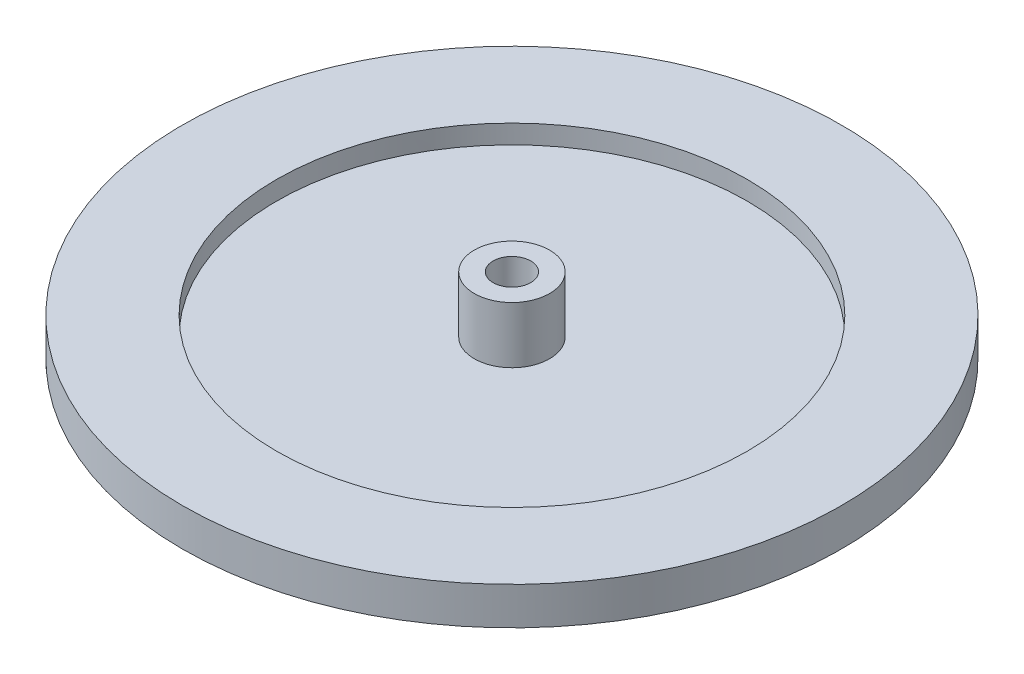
ISO-10303-21;
HEADER;
FILE_DESCRIPTION(('STEP AP214'),'2;1');
FILE_NAME('part.step','',(''),(''),'','','');
FILE_SCHEMA(('AUTOMOTIVE_DESIGN { 1 0 10303 214 1 1 1 1 }'));
ENDSEC;
DATA;
#1=APPLICATION_CONTEXT('core data for automotive mechanical design processes');
#2=APPLICATION_PROTOCOL_DEFINITION('international standard','automotive_design',2000,#1);
#3=PRODUCT_CONTEXT('',#1,'mechanical');
#4=PRODUCT('Part','Part','',(#3));
#5=PRODUCT_RELATED_PRODUCT_CATEGORY('part','',(#4));
#6=PRODUCT_DEFINITION_FORMATION('','',#4);
#7=PRODUCT_DEFINITION_CONTEXT('part definition',#1,'design');
#8=PRODUCT_DEFINITION('design','',#6,#7);
#9=PRODUCT_DEFINITION_SHAPE('','',#8);
#10=(LENGTH_UNIT() NAMED_UNIT(*) SI_UNIT(.MILLI.,.METRE.));
#11=(NAMED_UNIT(*) PLANE_ANGLE_UNIT() SI_UNIT($,.RADIAN.));
#12=(NAMED_UNIT(*) SI_UNIT($,.STERADIAN.) SOLID_ANGLE_UNIT());
#13=UNCERTAINTY_MEASURE_WITH_UNIT(LENGTH_MEASURE(1.E-05),#10,'distance_accuracy_value','');
#14=(GEOMETRIC_REPRESENTATION_CONTEXT(3) GLOBAL_UNCERTAINTY_ASSIGNED_CONTEXT((#13)) GLOBAL_UNIT_ASSIGNED_CONTEXT((#10,
#11,#12)) REPRESENTATION_CONTEXT('',''));
#15=CARTESIAN_POINT('',(0.,0.,0.));
#16=DIRECTION('',(0.,0.,1.));
#17=DIRECTION('',(1.,0.,0.));
#18=AXIS2_PLACEMENT_3D('',#15,#16,#17);
#19=CARTESIAN_POINT('',(0.,4.,0.));
#20=DIRECTION('',(0.,-1.,0.));
#21=DIRECTION('',(0.,0.,-1.));
#22=AXIS2_PLACEMENT_3D('',#19,#20,#21);
#23=CYLINDRICAL_SURFACE('',#22,25.);
#24=CARTESIAN_POINT('',(0.,4.,0.));
#25=DIRECTION('',(0.,1.,0.));
#26=DIRECTION('',(0.,0.,1.));
#27=AXIS2_PLACEMENT_3D('',#24,#25,#26);
#28=CIRCLE('',#27,25.);
#29=CARTESIAN_POINT('',(0.,4.,25.));
#30=VERTEX_POINT('',#29);
#31=EDGE_CURVE('E126',#30,#30,#28,.T.);
#32=ORIENTED_EDGE('',*,*,#31,.T.);
#33=EDGE_LOOP('',(#32));
#34=FACE_BOUND('',#33,.T.);
#35=CARTESIAN_POINT('',(0.,2.,0.));
#36=DIRECTION('',(0.,-1.,0.));
#37=DIRECTION('',(0.,0.,-1.));
#38=AXIS2_PLACEMENT_3D('',#35,#36,#37);
#39=CIRCLE('',#38,25.);
#40=CARTESIAN_POINT('',(0.,2.,-25.));
#41=VERTEX_POINT('',#40);
#42=EDGE_CURVE('E123',#41,#41,#39,.F.);
#43=ORIENTED_EDGE('',*,*,#42,.F.);
#44=EDGE_LOOP('',(#43));
#45=FACE_BOUND('',#44,.T.);
#46=ADVANCED_FACE('F39',(#34,#45),#23,.F.);
#47=CARTESIAN_POINT('',(0.,4.,0.));
#48=DIRECTION('',(0.,1.,0.));
#49=DIRECTION('',(0.,0.,1.));
#50=AXIS2_PLACEMENT_3D('',#47,#48,#49);
#51=PLANE('',#50);
#52=CARTESIAN_POINT('',(0.,4.,0.));
#53=DIRECTION('',(0.,1.,0.));
#54=DIRECTION('',(0.,0.,1.));
#55=AXIS2_PLACEMENT_3D('',#52,#53,#54);
#56=CIRCLE('',#55,35.);
#57=CARTESIAN_POINT('',(0.,4.,35.));
#58=VERTEX_POINT('',#57);
#59=EDGE_CURVE('E132',#58,#58,#56,.T.);
#60=ORIENTED_EDGE('',*,*,#59,.T.);
#61=EDGE_LOOP('',(#60));
#62=FACE_BOUND('',#61,.T.);
#63=ORIENTED_EDGE('',*,*,#31,.F.);
#64=EDGE_LOOP('',(#63));
#65=FACE_BOUND('',#64,.T.);
#66=ADVANCED_FACE('F142',(#62,#65),#51,.T.);
#67=CARTESIAN_POINT('',(0.,0.,0.));
#68=DIRECTION('',(0.,1.,0.));
#69=DIRECTION('',(0.,0.,1.));
#70=AXIS2_PLACEMENT_3D('',#67,#68,#69);
#71=PLANE('',#70);
#72=CARTESIAN_POINT('',(0.,0.,0.));
#73=DIRECTION('',(0.,1.,0.));
#74=DIRECTION('',(0.,0.,1.));
#75=AXIS2_PLACEMENT_3D('',#72,#73,#74);
#76=CIRCLE('',#75,35.);
#77=CARTESIAN_POINT('',(0.,0.,35.));
#78=VERTEX_POINT('',#77);
#79=EDGE_CURVE('E131',#78,#78,#76,.T.);
#80=ORIENTED_EDGE('',*,*,#79,.F.);
#81=EDGE_LOOP('',(#80));
#82=FACE_BOUND('',#81,.T.);
#83=CARTESIAN_POINT('',(0.,0.,0.));
#84=DIRECTION('',(0.,-1.,0.));
#85=DIRECTION('',(0.,0.,-1.));
#86=AXIS2_PLACEMENT_3D('',#83,#84,#85);
#87=CIRCLE('',#86,4.);
#88=CARTESIAN_POINT('',(0.,0.,-4.));
#89=VERTEX_POINT('',#88);
#90=EDGE_CURVE('E122',#89,#89,#87,.T.);
#91=ORIENTED_EDGE('',*,*,#90,.F.);
#92=EDGE_LOOP('',(#91));
#93=FACE_BOUND('',#92,.T.);
#94=ADVANCED_FACE('F139',(#82,#93),#71,.F.);
#95=CARTESIAN_POINT('',(0.,4.,0.));
#96=DIRECTION('',(0.,-1.,0.));
#97=DIRECTION('',(0.,0.,-1.));
#98=AXIS2_PLACEMENT_3D('',#95,#96,#97);
#99=CYLINDRICAL_SURFACE('',#98,35.);
#100=ORIENTED_EDGE('',*,*,#59,.F.);
#101=EDGE_LOOP('',(#100));
#102=FACE_BOUND('',#101,.T.);
#103=ORIENTED_EDGE('',*,*,#79,.T.);
#104=EDGE_LOOP('',(#103));
#105=FACE_BOUND('',#104,.T.);
#106=ADVANCED_FACE('F41',(#102,#105),#99,.T.);
#107=CARTESIAN_POINT('',(0.,2.,0.));
#108=DIRECTION('',(0.,-1.,0.));
#109=DIRECTION('',(0.,0.,-1.));
#110=AXIS2_PLACEMENT_3D('',#107,#108,#109);
#111=PLANE('',#110);
#112=ORIENTED_EDGE('',*,*,#42,.T.);
#113=EDGE_LOOP('',(#112));
#114=FACE_BOUND('',#113,.T.);
#115=CARTESIAN_POINT('',(0.,2.,0.));
#116=DIRECTION('',(0.,-1.,0.));
#117=DIRECTION('',(0.,0.,-1.));
#118=AXIS2_PLACEMENT_3D('',#115,#116,#117);
#119=CIRCLE('',#118,4.);
#120=CARTESIAN_POINT('',(0.,2.,-4.));
#121=VERTEX_POINT('',#120);
#122=EDGE_CURVE('E119',#121,#121,#119,.T.);
#123=ORIENTED_EDGE('',*,*,#122,.T.);
#124=EDGE_LOOP('',(#123));
#125=FACE_BOUND('',#124,.T.);
#126=ADVANCED_FACE('F148',(#114,#125),#111,.F.);
#127=CARTESIAN_POINT('',(0.,8.,0.));
#128=DIRECTION('',(0.,-1.,0.));
#129=DIRECTION('',(0.,0.,-1.));
#130=AXIS2_PLACEMENT_3D('',#127,#128,#129);
#131=CYLINDRICAL_SURFACE('',#130,4.);
#132=CARTESIAN_POINT('',(0.,-10.,0.));
#133=DIRECTION('',(0.,-1.,0.));
#134=DIRECTION('',(0.,0.,-1.));
#135=AXIS2_PLACEMENT_3D('',#132,#133,#134);
#136=CIRCLE('',#135,4.);
#137=CARTESIAN_POINT('',(0.,-10.,-4.));
#138=VERTEX_POINT('',#137);
#139=EDGE_CURVE('E110',#138,#138,#136,.T.);
#140=ORIENTED_EDGE('',*,*,#139,.F.);
#141=EDGE_LOOP('',(#140));
#142=FACE_BOUND('',#141,.T.);
#143=ORIENTED_EDGE('',*,*,#90,.T.);
#144=EDGE_LOOP('',(#143));
#145=FACE_BOUND('',#144,.T.);
#146=ADVANCED_FACE('F145',(#142,#145),#131,.T.);
#147=CARTESIAN_POINT('',(0.,8.,0.));
#148=DIRECTION('',(0.,-1.,0.));
#149=DIRECTION('',(0.,0.,-1.));
#150=AXIS2_PLACEMENT_3D('',#147,#148,#149);
#151=CIRCLE('',#150,4.);
#152=CARTESIAN_POINT('',(0.,8.,-4.));
#153=VERTEX_POINT('',#152);
#154=EDGE_CURVE('E116',#153,#153,#151,.T.);
#155=ORIENTED_EDGE('',*,*,#154,.T.);
#156=EDGE_LOOP('',(#155));
#157=FACE_BOUND('',#156,.T.);
#158=ORIENTED_EDGE('',*,*,#122,.F.);
#159=EDGE_LOOP('',(#158));
#160=FACE_BOUND('',#159,.T.);
#161=ADVANCED_FACE('F147',(#157,#160),#131,.T.);
#162=CARTESIAN_POINT('',(0.,8.,0.));
#163=DIRECTION('',(0.,-1.,0.));
#164=DIRECTION('',(0.,0.,-1.));
#165=AXIS2_PLACEMENT_3D('',#162,#163,#164);
#166=PLANE('',#165);
#167=CARTESIAN_POINT('',(0.,8.,0.));
#168=DIRECTION('',(0.,-1.,0.));
#169=DIRECTION('',(0.,0.,-1.));
#170=AXIS2_PLACEMENT_3D('',#167,#168,#169);
#171=CIRCLE('',#170,2.);
#172=CARTESIAN_POINT('',(0.,8.,-2.));
#173=VERTEX_POINT('',#172);
#174=EDGE_CURVE('E113',#173,#173,#171,.T.);
#175=ORIENTED_EDGE('',*,*,#174,.T.);
#176=EDGE_LOOP('',(#175));
#177=FACE_BOUND('',#176,.T.);
#178=ORIENTED_EDGE('',*,*,#154,.F.);
#179=EDGE_LOOP('',(#178));
#180=FACE_BOUND('',#179,.T.);
#181=ADVANCED_FACE('F155',(#177,#180),#166,.F.);
#182=CARTESIAN_POINT('',(0.,8.,0.));
#183=DIRECTION('',(0.,-1.,0.));
#184=DIRECTION('',(0.,0.,-1.));
#185=AXIS2_PLACEMENT_3D('',#182,#183,#184);
#186=CYLINDRICAL_SURFACE('',#185,2.);
#187=ORIENTED_EDGE('',*,*,#174,.F.);
#188=EDGE_LOOP('',(#187));
#189=FACE_BOUND('',#188,.T.);
#190=CARTESIAN_POINT('',(0.,0.,0.));
#191=DIRECTION('',(0.,-1.,0.));
#192=DIRECTION('',(0.,0.,-1.));
#193=AXIS2_PLACEMENT_3D('',#190,#191,#192);
#194=CIRCLE('',#193,2.);
#195=CARTESIAN_POINT('',(-0.8,0.,1.83303027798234));
#196=VERTEX_POINT('',#195);
#197=CARTESIAN_POINT('',(0.8,0.,1.83303027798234));
#198=VERTEX_POINT('',#197);
#199=EDGE_CURVE('E11',#196,#198,#194,.F.);
#200=ORIENTED_EDGE('',*,*,#199,.F.);
#201=DIRECTION('',(0.,-1.,0.));
#202=VECTOR('',#201,1.);
#203=CARTESIAN_POINT('',(-0.8,8.,1.83303027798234));
#204=LINE('',#203,#202);
#205=CARTESIAN_POINT('',(-0.8,-10.,1.83303027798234));
#206=VERTEX_POINT('',#205);
#207=EDGE_CURVE('E62',#196,#206,#204,.T.);
#208=ORIENTED_EDGE('',*,*,#207,.T.);
#209=CARTESIAN_POINT('',(0.,-10.,0.));
#210=DIRECTION('',(0.,-1.,0.));
#211=DIRECTION('',(0.,0.,-1.));
#212=AXIS2_PLACEMENT_3D('',#209,#210,#211);
#213=CIRCLE('',#212,2.);
#214=CARTESIAN_POINT('',(0.8,-10.,1.83303027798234));
#215=VERTEX_POINT('',#214);
#216=EDGE_CURVE('E107',#206,#215,#213,.T.);
#217=ORIENTED_EDGE('',*,*,#216,.T.);
#218=DIRECTION('',(0.,-1.,0.));
#219=VECTOR('',#218,1.);
#220=CARTESIAN_POINT('',(0.8,8.,1.83303027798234));
#221=LINE('',#220,#219);
#222=EDGE_CURVE('E54',#215,#198,#221,.F.);
#223=ORIENTED_EDGE('',*,*,#222,.T.);
#224=EDGE_LOOP('',(#200,#208,#217,#223));
#225=FACE_BOUND('',#224,.T.);
#226=ADVANCED_FACE('F211',(#189,#225),#186,.F.);
#227=CARTESIAN_POINT('',(0.,-10.,0.));
#228=DIRECTION('',(0.,-1.,0.));
#229=DIRECTION('',(0.,0.,-1.));
#230=AXIS2_PLACEMENT_3D('',#227,#228,#229);
#231=PLANE('',#230);
#232=DIRECTION('',(0.,0.,-1.));
#233=VECTOR('',#232,1.);
#234=CARTESIAN_POINT('',(-0.8,-10.,3.));
#235=LINE('',#234,#233);
#236=CARTESIAN_POINT('',(-0.8,-10.,3.));
#237=VERTEX_POINT('',#236);
#238=EDGE_CURVE('E100',#237,#206,#235,.T.);
#239=ORIENTED_EDGE('',*,*,#238,.F.);
#240=DIRECTION('',(-1.,0.,0.));
#241=VECTOR('',#240,1.);
#242=CARTESIAN_POINT('',(0.8,-10.,3.));
#243=LINE('',#242,#241);
#244=CARTESIAN_POINT('',(0.8,-10.,3.));
#245=VERTEX_POINT('',#244);
#246=EDGE_CURVE('E102',#245,#237,#243,.T.);
#247=ORIENTED_EDGE('',*,*,#246,.F.);
#248=DIRECTION('',(0.,0.,1.));
#249=VECTOR('',#248,1.);
#250=CARTESIAN_POINT('',(0.8,-10.,0.));
#251=LINE('',#250,#249);
#252=EDGE_CURVE('E47',#215,#245,#251,.T.);
#253=ORIENTED_EDGE('',*,*,#252,.F.);
#254=ORIENTED_EDGE('',*,*,#216,.F.);
#255=EDGE_LOOP('',(#239,#247,#253,#254));
#256=FACE_BOUND('',#255,.T.);
#257=ORIENTED_EDGE('',*,*,#139,.T.);
#258=EDGE_LOOP('',(#257));
#259=FACE_BOUND('',#258,.T.);
#260=ADVANCED_FACE('F220',(#256,#259),#231,.T.);
#261=CARTESIAN_POINT('',(0.,0.,0.));
#262=DIRECTION('',(0.,-1.,0.));
#263=DIRECTION('',(0.,0.,-1.));
#264=AXIS2_PLACEMENT_3D('',#261,#262,#263);
#265=PLANE('',#264);
#266=ORIENTED_EDGE('',*,*,#199,.T.);
#267=DIRECTION('',(0.,0.,1.));
#268=VECTOR('',#267,1.);
#269=CARTESIAN_POINT('',(0.8,0.,3.));
#270=LINE('',#269,#268);
#271=CARTESIAN_POINT('',(0.8,0.,3.));
#272=VERTEX_POINT('',#271);
#273=EDGE_CURVE('E80',#198,#272,#270,.T.);
#274=ORIENTED_EDGE('',*,*,#273,.T.);
#275=DIRECTION('',(-1.,0.,0.));
#276=VECTOR('',#275,1.);
#277=CARTESIAN_POINT('',(0.8,0.,3.));
#278=LINE('',#277,#276);
#279=CARTESIAN_POINT('',(-0.8,0.,3.));
#280=VERTEX_POINT('',#279);
#281=EDGE_CURVE('E84',#272,#280,#278,.T.);
#282=ORIENTED_EDGE('',*,*,#281,.T.);
#283=DIRECTION('',(0.,0.,-1.));
#284=VECTOR('',#283,1.);
#285=CARTESIAN_POINT('',(-0.8,0.,3.));
#286=LINE('',#285,#284);
#287=EDGE_CURVE('E86',#280,#196,#286,.T.);
#288=ORIENTED_EDGE('',*,*,#287,.T.);
#289=EDGE_LOOP('',(#266,#274,#282,#288));
#290=FACE_BOUND('',#289,.T.);
#291=ADVANCED_FACE('F82',(#290),#265,.T.);
#292=CARTESIAN_POINT('',(-0.8,0.,3.));
#293=DIRECTION('',(-1.,0.,0.));
#294=DIRECTION('',(0.,0.,1.));
#295=AXIS2_PLACEMENT_3D('',#292,#293,#294);
#296=PLANE('',#295);
#297=ORIENTED_EDGE('',*,*,#287,.F.);
#298=DIRECTION('',(0.,-1.,0.));
#299=VECTOR('',#298,1.);
#300=CARTESIAN_POINT('',(-0.8,0.,3.));
#301=LINE('',#300,#299);
#302=EDGE_CURVE('E94',#280,#237,#301,.T.);
#303=ORIENTED_EDGE('',*,*,#302,.T.);
#304=ORIENTED_EDGE('',*,*,#238,.T.);
#305=ORIENTED_EDGE('',*,*,#207,.F.);
#306=EDGE_LOOP('',(#297,#303,#304,#305));
#307=FACE_BOUND('',#306,.T.);
#308=ADVANCED_FACE('F239',(#307),#296,.F.);
#309=CARTESIAN_POINT('',(0.8,0.,3.));
#310=DIRECTION('',(1.,0.,0.));
#311=DIRECTION('',(0.,0.,-1.));
#312=AXIS2_PLACEMENT_3D('',#309,#310,#311);
#313=PLANE('',#312);
#314=ORIENTED_EDGE('',*,*,#252,.T.);
#315=DIRECTION('',(0.,-1.,0.));
#316=VECTOR('',#315,1.);
#317=CARTESIAN_POINT('',(0.8,0.,3.));
#318=LINE('',#317,#316);
#319=EDGE_CURVE('E89',#272,#245,#318,.T.);
#320=ORIENTED_EDGE('',*,*,#319,.F.);
#321=ORIENTED_EDGE('',*,*,#273,.F.);
#322=ORIENTED_EDGE('',*,*,#222,.F.);
#323=EDGE_LOOP('',(#314,#320,#321,#322));
#324=FACE_BOUND('',#323,.T.);
#325=ADVANCED_FACE('F90',(#324),#313,.F.);
#326=CARTESIAN_POINT('',(0.8,0.,3.));
#327=DIRECTION('',(0.,0.,1.));
#328=DIRECTION('',(1.,0.,0.));
#329=AXIS2_PLACEMENT_3D('',#326,#327,#328);
#330=PLANE('',#329);
#331=ORIENTED_EDGE('',*,*,#246,.T.);
#332=ORIENTED_EDGE('',*,*,#302,.F.);
#333=ORIENTED_EDGE('',*,*,#281,.F.);
#334=ORIENTED_EDGE('',*,*,#319,.T.);
#335=EDGE_LOOP('',(#331,#332,#333,#334));
#336=FACE_BOUND('',#335,.T.);
#337=ADVANCED_FACE('F96',(#336),#330,.F.);
#338=CLOSED_SHELL('',(#46,#66,#94,#106,#126,#146,#161,#181,#226,#260,#291,#308,#325,#337));
#339=MANIFOLD_SOLID_BREP('B2',#338);
#340=ADVANCED_BREP_SHAPE_REPRESENTATION('',(#18,#339),#14);
#341=SHAPE_DEFINITION_REPRESENTATION(#9,#340);
ENDSEC;
END-ISO-10303-21;
